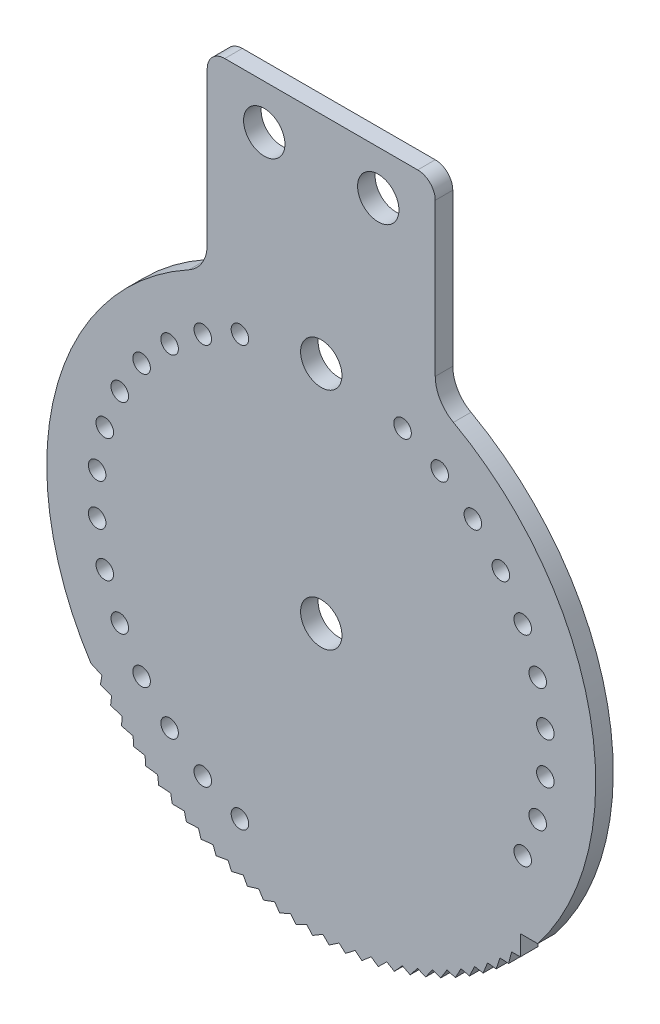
from build123d import *

# Parameters (mm, degrees)
SKETCH3_R           = 1.27
SKETCH3_R_2         = 2.992510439
BOSS_EXTRUDE1_DEPTH = 2.54


with BuildPart() as part:
    # Sketch3 → Boss-Extrude1 (new body)
    with BuildSketch(Plane.XY):
        with BuildLine():
            ThreePointArc((19.136064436, 34.779163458), (17.21042324, 36.644902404), (16.502837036, 39.231096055))
            Line((16.502837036, 39.231096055), (16.502837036, 61.301906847))
            ThreePointArc((16.502837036, 61.301906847), (15.75888826, 63.097958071), (13.962837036, 63.841906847))
            Line((13.962837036, 63.841906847), (-13.962837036, 63.841906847))
            ThreePointArc((-13.962837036, 63.841906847), (-15.75888826, 63.097958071), (-16.502837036, 61.301906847))
            Line((-16.502837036, 61.301906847), (-16.502837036, 39.231096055))
            ThreePointArc((-16.502837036, 39.231096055), (-17.21042324, 36.644902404), (-19.136064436, 34.779163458))
            ThreePointArc((-19.136064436, 34.779163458), (-38.530415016, 9.651592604), (-33.331361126, -21.661431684))
            Line((-33.331361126, -21.661431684), (-31.749030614, -22.384406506))
            Line((-31.749030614, -22.384406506), (-31.968135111, -23.627009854))
            Line((-31.968135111, -23.627009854), (-30.345184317, -24.2535026))
            Line((-30.345184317, -24.2535026), (-30.489152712, -25.507034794))
            Line((-30.489152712, -25.507034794), (-28.831458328, -26.034776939))
            Line((-28.831458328, -26.034776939), (-28.899769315, -27.294698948))
            Line((-28.899769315, -27.294698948), (-27.21333384, -27.721779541))
            Line((-27.21333384, -27.721779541), (-27.205740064, -28.983529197))
            Line((-27.205740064, -28.983529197), (-25.49667007, -29.308401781))
            Line((-25.49667007, -29.308401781), (-25.413199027, -30.567410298))
            Line((-25.413199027, -30.567410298), (-23.687683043, -30.788898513))
            Line((-23.687683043, -30.788898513), (-23.528636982, -32.04060703))
            Line((-23.528636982, -32.04060703), (-21.792923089, -32.157908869))
            Line((-21.792923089, -32.157908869), (-21.558877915, -33.397784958))
            Line((-21.558877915, -33.397784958), (-19.81925112, -33.410475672))
            Line((-19.81925112, -33.410475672), (-19.511054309, -34.634029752))
            Line((-19.511054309, -34.634029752), (-17.773813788, -34.542063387))
            Line((-17.773813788, -34.542063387), (-17.392581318, -35.744864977))
            Line((-17.392581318, -35.744864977), (-15.664017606, -35.548574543))
            Line((-15.664017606, -35.548574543), (-15.211129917, -36.726268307))
            Line((-15.211129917, -36.726268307), (-13.497502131, -36.426364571))
            Line((-13.497502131, -36.426364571), (-12.974599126, -37.574686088))
            Line((-12.974599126, -37.574686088), (-11.282112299, -37.172254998))
            Line((-11.282112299, -37.172254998), (-10.691087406, -38.287046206))
            Line((-10.691087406, -38.287046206), (-9.025870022, -37.783544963))
            Line((-9.025870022, -37.783544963), (-8.368863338, -38.860769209))
            Line((-8.368863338, -38.860769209), (-6.736945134, -38.258020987))
            Line((-6.736945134, -38.258020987), (-6.016335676, -39.293777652))
            Line((-6.016335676, -39.293777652), (-4.423625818, -38.593964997))
            Line((-4.423625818, -38.593964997), (-3.642022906, -39.584503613))
            Line((-3.642022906, -39.584503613), (-2.094288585, -38.790160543))
            Line((-2.094288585, -38.790160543), (-1.254522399, -39.731894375))
            Line((-1.254522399, -39.731894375), (0.242632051, -38.8458972))
            Line((0.242632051, -38.8458972), (1.137520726, -39.735416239))
            Line((1.137520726, -39.735416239), (2.578674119, -38.760973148))
            Line((2.578674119, -38.760973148), (3.525444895, -39.595056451))
            Line((3.525444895, -39.595056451), (4.905378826, -38.535695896))
            Line((4.905378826, -38.535695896), (5.900603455, -39.311323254))
            Line((5.900603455, -39.311323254), (7.214321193, -38.17088117))
            Line((7.214321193, -38.17088117), (8.254395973, -38.885244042))
            Line((8.254395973, -38.885244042), (9.497140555, -37.667849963))
            Line((9.497140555, -37.667849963), (10.578299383, -38.318361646))
            Line((10.578299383, -38.318361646), (11.745570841, -37.028423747))
            Line((11.745570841, -37.028423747), (12.863898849, -37.612728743))
            Line((12.863898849, -37.612728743), (13.951470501, -36.25491788))
            Line((13.951470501, -36.25491788), (15.102918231, -36.770900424))
            Line((15.102918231, -36.770900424), (16.106851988, -35.350133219))
            Line((16.106851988, -35.350133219), (17.287250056, -35.795924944))
            Line((17.287250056, -35.795924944), (18.203910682, -34.317345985))
            Line((18.203910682, -34.317345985), (19.408984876, -34.691332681))
            Line((19.408984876, -34.691332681), (20.235053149, -33.160295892))
            Line((20.235053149, -33.160295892), (21.460439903, -33.461123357))
            Line((21.460439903, -33.461123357), (22.192924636, -31.883172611))
            Line((22.192924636, -31.883172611), (23.434186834, -32.109751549))
            Line((23.434186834, -32.109751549), (24.070435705, -30.490600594))
            Line((24.070435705, -30.490600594), (25.323078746, -30.642110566))
            Line((25.323078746, -30.642110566), (25.860787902, -28.987622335))
            Line((25.860787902, -28.987622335), (27.120275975, -29.063514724))
            Line((27.120275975, -29.063514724), (27.557498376, -27.379680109))
            Line((27.557498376, -27.379680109), (28.819270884, -27.379680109))
            Line((28.819270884, -27.379680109), (28.819270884, -24.466742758))
            Line((28.819270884, -24.466742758), (31.333613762, -24.466742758))
            ThreePointArc((31.333613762, -24.466742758), (38.91421919, 7.972521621), (19.136064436, 34.779163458))
        make_face()
        with Locations((-21.947136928, -24.074862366)):
            Circle(SKETCH3_R, mode=Mode.SUBTRACT)
        with Locations((-25.997189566, -19.632166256)):
            Circle(SKETCH3_R, mode=Mode.SUBTRACT)
        with Locations((-29.161939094, -14.520920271)):
            Circle(SKETCH3_R, mode=Mode.SUBTRACT)
        with Locations((-17.149700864, -27.697717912)):
            Circle(SKETCH3_R, mode=Mode.SUBTRACT)
        with Locations((-11.768252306, -30.377360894)):
            Circle(SKETCH3_R, mode=Mode.SUBTRACT)
        with Locations((-31.333613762, -8.915181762)):
            Circle(SKETCH3_R, mode=Mode.SUBTRACT)
        with Locations((-32.438259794, -3.00584743)):
            Circle(SKETCH3_R, mode=Mode.SUBTRACT)
        with Locations((-32.438259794, 3.00584743)):
            Circle(SKETCH3_R, mode=Mode.SUBTRACT)
        with Locations((-31.333613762, 8.915181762)):
            Circle(SKETCH3_R, mode=Mode.SUBTRACT)
        with Locations((29.161939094, -14.520920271)):
            Circle(SKETCH3_R, mode=Mode.SUBTRACT)
        Circle(SKETCH3_R_2, mode=Mode.SUBTRACT)
        with Locations((31.333613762, -8.915181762)):
            Circle(SKETCH3_R, mode=Mode.SUBTRACT)
        with Locations((32.438259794, -3.00584743)):
            Circle(SKETCH3_R, mode=Mode.SUBTRACT)
        with Locations((32.438259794, 3.00584743)):
            Circle(SKETCH3_R, mode=Mode.SUBTRACT)
        with Locations((31.333613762, 8.915181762)):
            Circle(SKETCH3_R, mode=Mode.SUBTRACT)
        with Locations((-29.161939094, 14.520920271)):
            Circle(SKETCH3_R, mode=Mode.SUBTRACT)
        with Locations((-25.997189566, 19.632166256)):
            Circle(SKETCH3_R, mode=Mode.SUBTRACT)
        with Locations((-21.947136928, 24.074862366)):
            Circle(SKETCH3_R, mode=Mode.SUBTRACT)
        with Locations((-17.149700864, 27.697717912)):
            Circle(SKETCH3_R, mode=Mode.SUBTRACT)
        with Locations((-11.768252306, 30.377360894)):
            Circle(SKETCH3_R, mode=Mode.SUBTRACT)
        with Locations((-8.251418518, 57.453498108)):
            Circle(SKETCH3_R_2, mode=Mode.SUBTRACT)
        with Locations((0, 32.577228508)):
            Circle(SKETCH3_R_2, mode=Mode.SUBTRACT)
        with Locations((11.768252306, 30.377360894)):
            Circle(SKETCH3_R, mode=Mode.SUBTRACT)
        with Locations((17.149700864, 27.697717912)):
            Circle(SKETCH3_R, mode=Mode.SUBTRACT)
        with Locations((29.161939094, 14.520920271)):
            Circle(SKETCH3_R, mode=Mode.SUBTRACT)
        with Locations((21.947136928, 24.074862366)):
            Circle(SKETCH3_R, mode=Mode.SUBTRACT)
        with Locations((25.997189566, 19.632166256)):
            Circle(SKETCH3_R, mode=Mode.SUBTRACT)
        with Locations((8.251418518, 57.453498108)):
            Circle(SKETCH3_R_2, mode=Mode.SUBTRACT)
    extrude(amount=BOSS_EXTRUDE1_DEPTH)


solid = part.part
